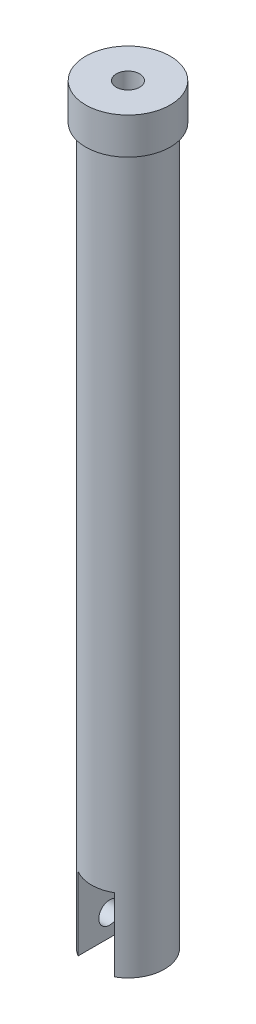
from build123d import *

# Parameters (mm, degrees)
ESQUISSE2_R                  = 50
ESQUISSE2_R_2                = 42
BOSS_EXTRU_1_DEPTH           = 875
BOSS_EXTRU_2_START           = 5
ESQUISSE3_R                  = 50
BOSS_EXTRU_2_DEPTH           = 5
BOSS_EXTRU_3_START           = 100
BOSS_EXTRU_3_DEPTH           = 100
ENL_V_MAT_EXTRU_1_DEPTH      = 45
ENL_V_MAT_EXTRU_1_DEPTH_BACK = 80
ESQUISSE5_R                  = 15
ESQUISSE6_R                  = 58
ESQUISSE6_R_2                = 16
BOSS_EXTRU_4_DEPTH           = 50


with BuildPart() as part:
    # Esquisse2 → Boss.-Extru.1 (new body)
    with BuildSketch(Plane(origin=(0, 0, 0), x_dir=(1, 0, 0), z_dir=(0, 1, 0))):
        with Locations(Location((0, 0, 0), (0, 0, 270))):
            Circle(ESQUISSE2_R)
        with Locations(Location((0, 0, 0), (0, 0, 270))):
            Circle(ESQUISSE2_R_2, mode=Mode.SUBTRACT)
    extrude(amount=BOSS_EXTRU_1_DEPTH)

    # Esquisse3 → Boss.-Extru.2 (add)
    with BuildSketch(Plane.XZ.offset(BOSS_EXTRU_2_START)):
        with Locations(Location((0, 0, 0), (0, 0, 270))):
            Circle(ESQUISSE3_R)
    extrude(amount=-BOSS_EXTRU_2_DEPTH)

    # Esquisse4 → Boss.-Extru.3 (add)
    with BuildSketch(Plane.XZ.offset(5).offset(BOSS_EXTRU_3_START)):
        with BuildLine():
            Line((-25, 43.301270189), (-25, -43.301270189))
            ThreePointArc((-25, -43.301270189), (-50, 0), (-25, 43.301270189))
        make_face()
        with BuildLine():
            Line((25, 43.301270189), (25, -43.301270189))
            ThreePointArc((25, -43.301270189), (50, 0), (25, 43.301270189))
        make_face()
    extrude(amount=-BOSS_EXTRU_3_DEPTH)

    # Esquisse5 → Enl_v. mat.-Extru.1 (cut, two sides: drawn at the far end of the back side and taken through both)
    with BuildSketch(Plane(origin=(0, 0, 0), x_dir=(0, 0, -1), z_dir=(1, 0, 0)).offset(-ENL_V_MAT_EXTRU_1_DEPTH_BACK)):
        with Locations(Location((0, -75, 0), (0, 0, 180))):
            Circle(ESQUISSE5_R)
    extrude(amount=ENL_V_MAT_EXTRU_1_DEPTH + ENL_V_MAT_EXTRU_1_DEPTH_BACK, mode=Mode.SUBTRACT)

    # Esquisse6 → Boss.-Extru.4 (add)
    with BuildSketch(Plane(origin=(0, 875, 0), x_dir=(1, 0, 0), z_dir=(0, 1, 0))):
        with Locations(Location((0, 0, 0), (0, 0, 270))):
            Circle(ESQUISSE6_R)
        with Locations(Location((0, 0, 0), (0, 0, 270))):
            Circle(ESQUISSE6_R_2, mode=Mode.SUBTRACT)
    extrude(amount=BOSS_EXTRU_4_DEPTH)


solid = part.part
